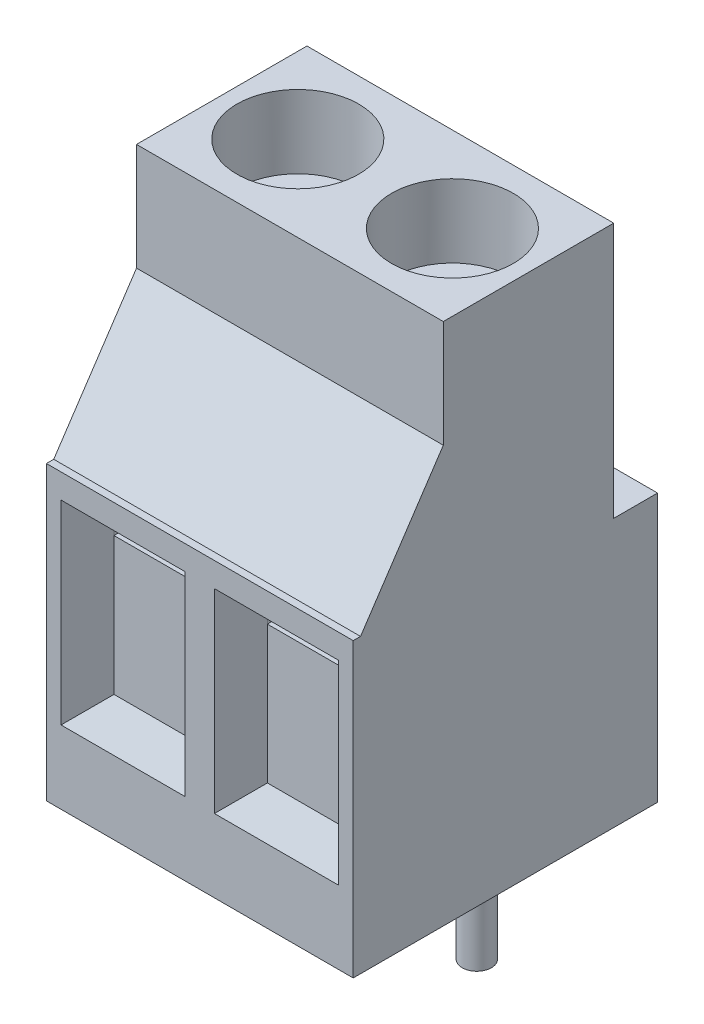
ISO-10303-21;
HEADER;
FILE_DESCRIPTION(('STEP AP214'),'2;1');
FILE_NAME('part.step','',(''),(''),'','','');
FILE_SCHEMA(('AUTOMOTIVE_DESIGN { 1 0 10303 214 1 1 1 1 }'));
ENDSEC;
DATA;
#1=APPLICATION_CONTEXT('core data for automotive mechanical design processes');
#2=APPLICATION_PROTOCOL_DEFINITION('international standard','automotive_design',2000,#1);
#3=PRODUCT_CONTEXT('',#1,'mechanical');
#4=PRODUCT('Part','Part','',(#3));
#5=PRODUCT_RELATED_PRODUCT_CATEGORY('part','',(#4));
#6=PRODUCT_DEFINITION_FORMATION('','',#4);
#7=PRODUCT_DEFINITION_CONTEXT('part definition',#1,'design');
#8=PRODUCT_DEFINITION('design','',#6,#7);
#9=PRODUCT_DEFINITION_SHAPE('','',#8);
#10=(LENGTH_UNIT() NAMED_UNIT(*) SI_UNIT(.MILLI.,.METRE.));
#11=(NAMED_UNIT(*) PLANE_ANGLE_UNIT() SI_UNIT($,.RADIAN.));
#12=(NAMED_UNIT(*) SI_UNIT($,.STERADIAN.) SOLID_ANGLE_UNIT());
#13=UNCERTAINTY_MEASURE_WITH_UNIT(LENGTH_MEASURE(1.E-05),#10,'distance_accuracy_value','');
#14=(GEOMETRIC_REPRESENTATION_CONTEXT(3) GLOBAL_UNCERTAINTY_ASSIGNED_CONTEXT((#13)) GLOBAL_UNIT_ASSIGNED_CONTEXT((#10,
#11,#12)) REPRESENTATION_CONTEXT('',''));
#15=CARTESIAN_POINT('',(0.,0.,0.));
#16=DIRECTION('',(0.,0.,1.));
#17=DIRECTION('',(1.,0.,0.));
#18=AXIS2_PLACEMENT_3D('',#15,#16,#17);
#19=CARTESIAN_POINT('',(0.6,3.,4.25));
#20=DIRECTION('',(0.,0.,1.));
#21=DIRECTION('',(1.,0.,0.));
#22=AXIS2_PLACEMENT_3D('',#19,#20,#21);
#23=PLANE('',#22);
#24=DIRECTION('',(0.,1.,0.));
#25=VECTOR('',#24,1.);
#26=CARTESIAN_POINT('',(5.52502267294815,3.,4.25));
#27=LINE('',#26,#25);
#28=CARTESIAN_POINT('',(5.52502267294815,3.17497732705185,4.25));
#29=VERTEX_POINT('',#28);
#30=CARTESIAN_POINT('',(5.52502267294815,8.82502267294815,4.25));
#31=VERTEX_POINT('',#30);
#32=EDGE_CURVE('E434',#29,#31,#27,.T.);
#33=ORIENTED_EDGE('',*,*,#32,.T.);
#34=DIRECTION('',(-1.,0.,0.));
#35=VECTOR('',#34,1.);
#36=CARTESIAN_POINT('',(5.52502267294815,8.82502267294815,4.25));
#37=LINE('',#36,#35);
#38=CARTESIAN_POINT('',(0.774977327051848,8.82502267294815,4.25));
#39=VERTEX_POINT('',#38);
#40=EDGE_CURVE('E264',#31,#39,#37,.T.);
#41=ORIENTED_EDGE('',*,*,#40,.T.);
#42=DIRECTION('',(0.,-1.,0.));
#43=VECTOR('',#42,1.);
#44=CARTESIAN_POINT('',(0.774977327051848,3.,4.25));
#45=LINE('',#44,#43);
#46=CARTESIAN_POINT('',(0.774977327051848,3.17497732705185,4.25));
#47=VERTEX_POINT('',#46);
#48=EDGE_CURVE('E436',#39,#47,#45,.T.);
#49=ORIENTED_EDGE('',*,*,#48,.T.);
#50=DIRECTION('',(1.,0.,0.));
#51=VECTOR('',#50,1.);
#52=CARTESIAN_POINT('',(0.6,3.17497732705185,4.25));
#53=LINE('',#52,#51);
#54=EDGE_CURVE('E421',#47,#29,#53,.T.);
#55=ORIENTED_EDGE('',*,*,#54,.T.);
#56=EDGE_LOOP('',(#33,#41,#49,#55));
#57=FACE_BOUND('',#56,.T.);
#58=ADVANCED_FACE('F36',(#57),#23,.T.);
#59=CARTESIAN_POINT('',(3.175,18.5,-0.95));
#60=DIRECTION('',(0.,1.,0.));
#61=DIRECTION('',(0.,0.,1.));
#62=AXIS2_PLACEMENT_3D('',#59,#60,#61);
#63=PLANE('',#62);
#64=CARTESIAN_POINT('',(3.175,18.5,-0.95));
#65=DIRECTION('',(0.,1.,0.));
#66=DIRECTION('',(0.,0.,1.));
#67=AXIS2_PLACEMENT_3D('',#64,#65,#66);
#68=CIRCLE('',#67,2.5);
#69=CARTESIAN_POINT('',(3.675,18.5,1.49948974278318));
#70=VERTEX_POINT('',#69);
#71=CARTESIAN_POINT('',(3.675,18.5,-3.39948974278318));
#72=VERTEX_POINT('',#71);
#73=EDGE_CURVE('E370',#70,#72,#68,.T.);
#74=ORIENTED_EDGE('',*,*,#73,.T.);
#75=DIRECTION('',(0.,0.,1.));
#76=VECTOR('',#75,1.);
#77=CARTESIAN_POINT('',(3.675,18.5,-3.39948974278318));
#78=LINE('',#77,#76);
#79=EDGE_CURVE('E298',#72,#70,#78,.T.);
#80=ORIENTED_EDGE('',*,*,#79,.T.);
#81=EDGE_LOOP('',(#74,#80));
#82=FACE_BOUND('',#81,.T.);
#83=ADVANCED_FACE('F536',(#82),#63,.T.);
#84=CARTESIAN_POINT('',(2.675,18.5,-3.39948974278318));
#85=VERTEX_POINT('',#84);
#86=CARTESIAN_POINT('',(2.675,18.5,1.49948974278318));
#87=VERTEX_POINT('',#86);
#88=EDGE_CURVE('E369',#85,#87,#68,.T.);
#89=ORIENTED_EDGE('',*,*,#88,.T.);
#90=DIRECTION('',(0.,0.,-1.));
#91=VECTOR('',#90,1.);
#92=CARTESIAN_POINT('',(2.675,18.5,-3.39948974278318));
#93=LINE('',#92,#91);
#94=EDGE_CURVE('E308',#87,#85,#93,.T.);
#95=ORIENTED_EDGE('',*,*,#94,.T.);
#96=EDGE_LOOP('',(#89,#95));
#97=FACE_BOUND('',#96,.T.);
#98=ADVANCED_FACE('F542',(#97),#63,.T.);
#99=CARTESIAN_POINT('',(-3.175,18.5,-0.949999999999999));
#100=DIRECTION('',(0.,-1.,0.));
#101=DIRECTION('',(0.,0.,-1.));
#102=AXIS2_PLACEMENT_3D('',#99,#100,#101);
#103=PLANE('',#102);
#104=DIRECTION('',(0.,0.,-1.));
#105=VECTOR('',#104,1.);
#106=CARTESIAN_POINT('',(-2.675,18.5,-3.39948974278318));
#107=LINE('',#106,#105);
#108=CARTESIAN_POINT('',(-2.675,18.5,1.49948974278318));
#109=VERTEX_POINT('',#108);
#110=CARTESIAN_POINT('',(-2.675,18.5,-3.39948974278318));
#111=VERTEX_POINT('',#110);
#112=EDGE_CURVE('E322',#109,#111,#107,.T.);
#113=ORIENTED_EDGE('',*,*,#112,.F.);
#114=CARTESIAN_POINT('',(-3.175,18.5,-0.949999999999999));
#115=DIRECTION('',(0.,1.,0.));
#116=DIRECTION('',(0.,0.,-1.));
#117=AXIS2_PLACEMENT_3D('',#114,#115,#116);
#118=CIRCLE('',#117,2.5);
#119=EDGE_CURVE('E362',#109,#111,#118,.T.);
#120=ORIENTED_EDGE('',*,*,#119,.T.);
#121=EDGE_LOOP('',(#113,#120));
#122=FACE_BOUND('',#121,.T.);
#123=ADVANCED_FACE('F661',(#122),#103,.F.);
#124=DIRECTION('',(0.,0.,1.));
#125=VECTOR('',#124,1.);
#126=CARTESIAN_POINT('',(-3.675,18.5,-3.39948974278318));
#127=LINE('',#126,#125);
#128=CARTESIAN_POINT('',(-3.675,18.5,-3.39948974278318));
#129=VERTEX_POINT('',#128);
#130=CARTESIAN_POINT('',(-3.675,18.5,1.49948974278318));
#131=VERTEX_POINT('',#130);
#132=EDGE_CURVE('E332',#129,#131,#127,.T.);
#133=ORIENTED_EDGE('',*,*,#132,.F.);
#134=EDGE_CURVE('E363',#129,#131,#118,.T.);
#135=ORIENTED_EDGE('',*,*,#134,.T.);
#136=EDGE_LOOP('',(#133,#135));
#137=FACE_BOUND('',#136,.T.);
#138=ADVANCED_FACE('F511',(#137),#103,.F.);
#139=CARTESIAN_POINT('',(-6.3,0.,6.25));
#140=DIRECTION('',(0.,1.,0.));
#141=DIRECTION('',(0.,0.,1.));
#142=AXIS2_PLACEMENT_3D('',#139,#140,#141);
#143=PLANE('',#142);
#144=CARTESIAN_POINT('',(-3.175,0.,-1.95));
#145=DIRECTION('',(0.,1.,0.));
#146=DIRECTION('',(0.,0.,1.));
#147=AXIS2_PLACEMENT_3D('',#144,#145,#146);
#148=CIRCLE('',#147,0.6);
#149=CARTESIAN_POINT('',(-3.175,0.,-1.35));
#150=VERTEX_POINT('',#149);
#151=EDGE_CURVE('E44',#150,#150,#148,.F.);
#152=ORIENTED_EDGE('',*,*,#151,.F.);
#153=EDGE_LOOP('',(#152));
#154=FACE_BOUND('',#153,.T.);
#155=DIRECTION('',(0.,0.,1.));
#156=VECTOR('',#155,1.);
#157=CARTESIAN_POINT('',(-6.3,0.,-6.25));
#158=LINE('',#157,#156);
#159=CARTESIAN_POINT('',(-6.3,0.,-6.25));
#160=VERTEX_POINT('',#159);
#161=CARTESIAN_POINT('',(-6.3,0.,6.25));
#162=VERTEX_POINT('',#161);
#163=EDGE_CURVE('E454',#160,#162,#158,.T.);
#164=ORIENTED_EDGE('',*,*,#163,.F.);
#165=DIRECTION('',(-1.,0.,0.));
#166=VECTOR('',#165,1.);
#167=CARTESIAN_POINT('',(-6.3,0.,-6.25));
#168=LINE('',#167,#166);
#169=CARTESIAN_POINT('',(6.3,0.,-6.25));
#170=VERTEX_POINT('',#169);
#171=EDGE_CURVE('E480',#170,#160,#168,.T.);
#172=ORIENTED_EDGE('',*,*,#171,.F.);
#173=DIRECTION('',(0.,0.,-1.));
#174=VECTOR('',#173,1.);
#175=CARTESIAN_POINT('',(6.3,0.,-6.25));
#176=LINE('',#175,#174);
#177=CARTESIAN_POINT('',(6.3,0.,6.25));
#178=VERTEX_POINT('',#177);
#179=EDGE_CURVE('E477',#178,#170,#176,.T.);
#180=ORIENTED_EDGE('',*,*,#179,.F.);
#181=DIRECTION('',(1.,0.,0.));
#182=VECTOR('',#181,1.);
#183=CARTESIAN_POINT('',(-6.3,0.,6.25));
#184=LINE('',#183,#182);
#185=EDGE_CURVE('E474',#162,#178,#184,.T.);
#186=ORIENTED_EDGE('',*,*,#185,.F.);
#187=EDGE_LOOP('',(#164,#172,#180,#186));
#188=FACE_BOUND('',#187,.T.);
#189=CARTESIAN_POINT('',(3.175,0.,-1.95));
#190=DIRECTION('',(0.,1.,0.));
#191=DIRECTION('',(0.,0.,1.));
#192=AXIS2_PLACEMENT_3D('',#189,#190,#191);
#193=CIRCLE('',#192,0.6);
#194=CARTESIAN_POINT('',(3.175,0.,-1.35));
#195=VERTEX_POINT('',#194);
#196=EDGE_CURVE('E11',#195,#195,#193,.F.);
#197=ORIENTED_EDGE('',*,*,#196,.F.);
#198=EDGE_LOOP('',(#197));
#199=FACE_BOUND('',#198,.T.);
#200=ADVANCED_FACE('F508',(#154,#188,#199),#143,.F.);
#201=CARTESIAN_POINT('',(-6.3,21.5,-6.25));
#202=DIRECTION('',(1.,0.,0.));
#203=DIRECTION('',(0.,0.,-1.));
#204=AXIS2_PLACEMENT_3D('',#201,#202,#203);
#205=PLANE('',#204);
#206=DIRECTION('',(0.,-1.,0.));
#207=VECTOR('',#206,1.);
#208=CARTESIAN_POINT('',(-6.3,22.334011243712,-4.45));
#209=LINE('',#208,#207);
#210=CARTESIAN_POINT('',(-6.3,21.5,-4.45));
#211=VERTEX_POINT('',#210);
#212=CARTESIAN_POINT('',(-6.3,11.,-4.45));
#213=VERTEX_POINT('',#212);
#214=EDGE_CURVE('E393',#211,#213,#209,.T.);
#215=ORIENTED_EDGE('',*,*,#214,.T.);
#216=DIRECTION('',(0.,0.,-1.));
#217=VECTOR('',#216,1.);
#218=CARTESIAN_POINT('',(-6.3,11.,-4.45));
#219=LINE('',#218,#217);
#220=CARTESIAN_POINT('',(-6.3,11.,-6.25));
#221=VERTEX_POINT('',#220);
#222=EDGE_CURVE('E396',#213,#221,#219,.T.);
#223=ORIENTED_EDGE('',*,*,#222,.T.);
#224=DIRECTION('',(0.,-1.,0.));
#225=VECTOR('',#224,1.);
#226=CARTESIAN_POINT('',(-6.3,21.5,-6.25));
#227=LINE('',#226,#225);
#228=EDGE_CURVE('E489',#221,#160,#227,.T.);
#229=ORIENTED_EDGE('',*,*,#228,.T.);
#230=ORIENTED_EDGE('',*,*,#163,.T.);
#231=DIRECTION('',(0.,-1.,0.));
#232=VECTOR('',#231,1.);
#233=CARTESIAN_POINT('',(-6.3,21.5,6.25));
#234=LINE('',#233,#232);
#235=CARTESIAN_POINT('',(-6.3,12.,6.25));
#236=VERTEX_POINT('',#235);
#237=EDGE_CURVE('E495',#236,#162,#234,.T.);
#238=ORIENTED_EDGE('',*,*,#237,.F.);
#239=DIRECTION('',(0.,0.,-1.));
#240=VECTOR('',#239,1.);
#241=CARTESIAN_POINT('',(-6.3,12.,7.70302030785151));
#242=LINE('',#241,#240);
#243=CARTESIAN_POINT('',(-6.3,12.,5.95));
#244=VERTEX_POINT('',#243);
#245=EDGE_CURVE('E384',#236,#244,#242,.T.);
#246=ORIENTED_EDGE('',*,*,#245,.T.);
#247=DIRECTION('',(0.,0.832050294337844,-0.554700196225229));
#248=VECTOR('',#247,1.);
#249=CARTESIAN_POINT('',(-6.3,12.,5.95));
#250=LINE('',#249,#248);
#251=CARTESIAN_POINT('',(-6.3,17.1,2.55));
#252=VERTEX_POINT('',#251);
#253=EDGE_CURVE('E387',#244,#252,#250,.T.);
#254=ORIENTED_EDGE('',*,*,#253,.T.);
#255=DIRECTION('',(0.,1.,0.));
#256=VECTOR('',#255,1.);
#257=CARTESIAN_POINT('',(-6.3,17.1,2.55));
#258=LINE('',#257,#256);
#259=CARTESIAN_POINT('',(-6.3,21.5,2.55));
#260=VERTEX_POINT('',#259);
#261=EDGE_CURVE('E390',#252,#260,#258,.T.);
#262=ORIENTED_EDGE('',*,*,#261,.T.);
#263=DIRECTION('',(0.,0.,1.));
#264=VECTOR('',#263,1.);
#265=CARTESIAN_POINT('',(-6.3,21.5,-6.25));
#266=LINE('',#265,#264);
#267=EDGE_CURVE('E483',#211,#260,#266,.T.);
#268=ORIENTED_EDGE('',*,*,#267,.F.);
#269=EDGE_LOOP('',(#215,#223,#229,#230,#238,#246,#254,#262,#268));
#270=FACE_BOUND('',#269,.T.);
#271=ADVANCED_FACE('F38',(#270),#205,.F.);
#272=CARTESIAN_POINT('',(-6.3,21.5,6.25));
#273=DIRECTION('',(0.,0.,-1.));
#274=DIRECTION('',(-1.,0.,0.));
#275=AXIS2_PLACEMENT_3D('',#272,#273,#274);
#276=PLANE('',#275);
#277=DIRECTION('',(0.,1.,0.));
#278=VECTOR('',#277,1.);
#279=CARTESIAN_POINT('',(5.7,3.,6.25));
#280=LINE('',#279,#278);
#281=CARTESIAN_POINT('',(5.7,3.,6.25));
#282=VERTEX_POINT('',#281);
#283=CARTESIAN_POINT('',(5.7,11.,6.25));
#284=VERTEX_POINT('',#283);
#285=EDGE_CURVE('E412',#282,#284,#280,.T.);
#286=ORIENTED_EDGE('',*,*,#285,.F.);
#287=DIRECTION('',(1.,0.,0.));
#288=VECTOR('',#287,1.);
#289=CARTESIAN_POINT('',(0.6,3.,6.25));
#290=LINE('',#289,#288);
#291=CARTESIAN_POINT('',(0.6,3.,6.25));
#292=VERTEX_POINT('',#291);
#293=EDGE_CURVE('E410',#292,#282,#290,.T.);
#294=ORIENTED_EDGE('',*,*,#293,.F.);
#295=DIRECTION('',(0.,-1.,0.));
#296=VECTOR('',#295,1.);
#297=CARTESIAN_POINT('',(0.6,3.,6.25));
#298=LINE('',#297,#296);
#299=CARTESIAN_POINT('',(0.6,11.,6.25));
#300=VERTEX_POINT('',#299);
#301=EDGE_CURVE('E418',#300,#292,#298,.T.);
#302=ORIENTED_EDGE('',*,*,#301,.F.);
#303=DIRECTION('',(-1.,0.,0.));
#304=VECTOR('',#303,1.);
#305=CARTESIAN_POINT('',(0.6,11.,6.25));
#306=LINE('',#305,#304);
#307=EDGE_CURVE('E415',#284,#300,#306,.T.);
#308=ORIENTED_EDGE('',*,*,#307,.F.);
#309=EDGE_LOOP('',(#286,#294,#302,#308));
#310=FACE_BOUND('',#309,.T.);
#311=DIRECTION('',(-1.,0.,0.));
#312=VECTOR('',#311,1.);
#313=CARTESIAN_POINT('',(-0.6,11.,6.25));
#314=LINE('',#313,#312);
#315=CARTESIAN_POINT('',(-0.599999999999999,11.,6.25));
#316=VERTEX_POINT('',#315);
#317=CARTESIAN_POINT('',(-5.7,11.,6.25));
#318=VERTEX_POINT('',#317);
#319=EDGE_CURVE('E442',#316,#318,#314,.T.);
#320=ORIENTED_EDGE('',*,*,#319,.F.);
#321=DIRECTION('',(0.,1.,0.));
#322=VECTOR('',#321,1.);
#323=CARTESIAN_POINT('',(-0.599999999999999,3.,6.25));
#324=LINE('',#323,#322);
#325=CARTESIAN_POINT('',(-0.599999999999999,3.,6.25));
#326=VERTEX_POINT('',#325);
#327=EDGE_CURVE('E424',#326,#316,#324,.T.);
#328=ORIENTED_EDGE('',*,*,#327,.F.);
#329=DIRECTION('',(1.,0.,0.));
#330=VECTOR('',#329,1.);
#331=CARTESIAN_POINT('',(-0.599999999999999,3.,6.25));
#332=LINE('',#331,#330);
#333=CARTESIAN_POINT('',(-5.7,3.,6.25));
#334=VERTEX_POINT('',#333);
#335=EDGE_CURVE('E448',#334,#326,#332,.T.);
#336=ORIENTED_EDGE('',*,*,#335,.F.);
#337=DIRECTION('',(0.,-1.,0.));
#338=VECTOR('',#337,1.);
#339=CARTESIAN_POINT('',(-5.7,3.,6.25));
#340=LINE('',#339,#338);
#341=EDGE_CURVE('E445',#318,#334,#340,.T.);
#342=ORIENTED_EDGE('',*,*,#341,.F.);
#343=EDGE_LOOP('',(#320,#328,#336,#342));
#344=FACE_BOUND('',#343,.T.);
#345=DIRECTION('',(0.,-1.,0.));
#346=VECTOR('',#345,1.);
#347=CARTESIAN_POINT('',(6.3,21.5,6.25));
#348=LINE('',#347,#346);
#349=CARTESIAN_POINT('',(6.3,12.,6.25));
#350=VERTEX_POINT('',#349);
#351=EDGE_CURVE('E493',#350,#178,#348,.T.);
#352=ORIENTED_EDGE('',*,*,#351,.F.);
#353=DIRECTION('',(-1.,0.,0.));
#354=VECTOR('',#353,1.);
#355=CARTESIAN_POINT('',(-6.3,12.,6.25));
#356=LINE('',#355,#354);
#357=EDGE_CURVE('E403',#350,#236,#356,.T.);
#358=ORIENTED_EDGE('',*,*,#357,.T.);
#359=ORIENTED_EDGE('',*,*,#237,.T.);
#360=ORIENTED_EDGE('',*,*,#185,.T.);
#361=EDGE_LOOP('',(#352,#358,#359,#360));
#362=FACE_BOUND('',#361,.T.);
#363=ADVANCED_FACE('F596',(#310,#344,#362),#276,.F.);
#364=CARTESIAN_POINT('',(6.3,21.5,-6.25));
#365=DIRECTION('',(-1.,0.,0.));
#366=DIRECTION('',(0.,0.,1.));
#367=AXIS2_PLACEMENT_3D('',#364,#365,#366);
#368=PLANE('',#367);
#369=DIRECTION('',(0.,-1.,0.));
#370=VECTOR('',#369,1.);
#371=CARTESIAN_POINT('',(6.3,21.5,-6.25));
#372=LINE('',#371,#370);
#373=CARTESIAN_POINT('',(6.3,11.,-6.25));
#374=VERTEX_POINT('',#373);
#375=EDGE_CURVE('E491',#374,#170,#372,.T.);
#376=ORIENTED_EDGE('',*,*,#375,.F.);
#377=DIRECTION('',(0.,0.,-1.));
#378=VECTOR('',#377,1.);
#379=CARTESIAN_POINT('',(6.3,11.,-4.45));
#380=LINE('',#379,#378);
#381=CARTESIAN_POINT('',(6.3,11.,-4.45));
#382=VERTEX_POINT('',#381);
#383=EDGE_CURVE('E382',#382,#374,#380,.T.);
#384=ORIENTED_EDGE('',*,*,#383,.F.);
#385=DIRECTION('',(0.,-1.,0.));
#386=VECTOR('',#385,1.);
#387=CARTESIAN_POINT('',(6.3,22.334011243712,-4.45));
#388=LINE('',#387,#386);
#389=CARTESIAN_POINT('',(6.3,21.5,-4.45));
#390=VERTEX_POINT('',#389);
#391=EDGE_CURVE('E380',#390,#382,#388,.T.);
#392=ORIENTED_EDGE('',*,*,#391,.F.);
#393=DIRECTION('',(0.,0.,-1.));
#394=VECTOR('',#393,1.);
#395=CARTESIAN_POINT('',(6.3,21.5,-6.25));
#396=LINE('',#395,#394);
#397=CARTESIAN_POINT('',(6.3,21.5,2.55));
#398=VERTEX_POINT('',#397);
#399=EDGE_CURVE('E486',#398,#390,#396,.T.);
#400=ORIENTED_EDGE('',*,*,#399,.F.);
#401=DIRECTION('',(0.,1.,0.));
#402=VECTOR('',#401,1.);
#403=CARTESIAN_POINT('',(6.3,17.1,2.55));
#404=LINE('',#403,#402);
#405=CARTESIAN_POINT('',(6.3,17.1,2.55));
#406=VERTEX_POINT('',#405);
#407=EDGE_CURVE('E378',#406,#398,#404,.T.);
#408=ORIENTED_EDGE('',*,*,#407,.F.);
#409=DIRECTION('',(0.,0.832050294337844,-0.554700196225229));
#410=VECTOR('',#409,1.);
#411=CARTESIAN_POINT('',(6.3,12.,5.95));
#412=LINE('',#411,#410);
#413=CARTESIAN_POINT('',(6.3,12.,5.95));
#414=VERTEX_POINT('',#413);
#415=EDGE_CURVE('E375',#414,#406,#412,.T.);
#416=ORIENTED_EDGE('',*,*,#415,.F.);
#417=DIRECTION('',(0.,0.,-1.));
#418=VECTOR('',#417,1.);
#419=CARTESIAN_POINT('',(6.3,12.,7.70302030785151));
#420=LINE('',#419,#418);
#421=EDGE_CURVE('E373',#350,#414,#420,.T.);
#422=ORIENTED_EDGE('',*,*,#421,.F.);
#423=ORIENTED_EDGE('',*,*,#351,.T.);
#424=ORIENTED_EDGE('',*,*,#179,.T.);
#425=EDGE_LOOP('',(#376,#384,#392,#400,#408,#416,#422,#423,#424));
#426=FACE_BOUND('',#425,.T.);
#427=ADVANCED_FACE('F593',(#426),#368,.F.);
#428=CARTESIAN_POINT('',(-6.3,21.5,-6.25));
#429=DIRECTION('',(0.,0.,1.));
#430=DIRECTION('',(1.,0.,0.));
#431=AXIS2_PLACEMENT_3D('',#428,#429,#430);
#432=PLANE('',#431);
#433=ORIENTED_EDGE('',*,*,#228,.F.);
#434=DIRECTION('',(1.,0.,0.));
#435=VECTOR('',#434,1.);
#436=CARTESIAN_POINT('',(-6.3,11.,-6.25));
#437=LINE('',#436,#435);
#438=EDGE_CURVE('E501',#221,#374,#437,.T.);
#439=ORIENTED_EDGE('',*,*,#438,.T.);
#440=ORIENTED_EDGE('',*,*,#375,.T.);
#441=ORIENTED_EDGE('',*,*,#171,.T.);
#442=EDGE_LOOP('',(#433,#439,#440,#441));
#443=FACE_BOUND('',#442,.T.);
#444=ADVANCED_FACE('F589',(#443),#432,.F.);
#445=CARTESIAN_POINT('',(-6.3,21.5,6.25));
#446=DIRECTION('',(0.,1.,0.));
#447=DIRECTION('',(0.,0.,1.));
#448=AXIS2_PLACEMENT_3D('',#445,#446,#447);
#449=PLANE('',#448);
#450=CARTESIAN_POINT('',(-3.175,21.5,-0.949999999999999));
#451=DIRECTION('',(0.,1.,0.));
#452=DIRECTION('',(0.,0.,-1.));
#453=AXIS2_PLACEMENT_3D('',#450,#451,#452);
#454=CIRCLE('',#453,2.5);
#455=CARTESIAN_POINT('',(-3.175,21.5,-3.45));
#456=VERTEX_POINT('',#455);
#457=EDGE_CURVE('E359',#456,#456,#454,.T.);
#458=ORIENTED_EDGE('',*,*,#457,.F.);
#459=EDGE_LOOP('',(#458));
#460=FACE_BOUND('',#459,.T.);
#461=CARTESIAN_POINT('',(3.175,21.5,-0.95));
#462=DIRECTION('',(0.,1.,0.));
#463=DIRECTION('',(0.,0.,1.));
#464=AXIS2_PLACEMENT_3D('',#461,#462,#463);
#465=CIRCLE('',#464,2.5);
#466=CARTESIAN_POINT('',(3.175,21.5,1.55));
#467=VERTEX_POINT('',#466);
#468=EDGE_CURVE('E366',#467,#467,#465,.T.);
#469=ORIENTED_EDGE('',*,*,#468,.F.);
#470=EDGE_LOOP('',(#469));
#471=FACE_BOUND('',#470,.T.);
#472=DIRECTION('',(1.,0.,0.));
#473=VECTOR('',#472,1.);
#474=CARTESIAN_POINT('',(-6.3,21.5,-4.45));
#475=LINE('',#474,#473);
#476=EDGE_CURVE('E499',#211,#390,#475,.T.);
#477=ORIENTED_EDGE('',*,*,#476,.F.);
#478=ORIENTED_EDGE('',*,*,#267,.T.);
#479=DIRECTION('',(-1.,0.,0.));
#480=VECTOR('',#479,1.);
#481=CARTESIAN_POINT('',(-6.3,21.5,2.55));
#482=LINE('',#481,#480);
#483=EDGE_CURVE('E497',#398,#260,#482,.T.);
#484=ORIENTED_EDGE('',*,*,#483,.F.);
#485=ORIENTED_EDGE('',*,*,#399,.T.);
#486=EDGE_LOOP('',(#477,#478,#484,#485));
#487=FACE_BOUND('',#486,.T.);
#488=ADVANCED_FACE('F575',(#460,#471,#487),#449,.T.);
#489=CARTESIAN_POINT('',(-0.599999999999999,3.,6.25));
#490=DIRECTION('',(0.996194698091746,0.,-0.0871557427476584));
#491=DIRECTION('',(-0.0871557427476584,0.,-0.996194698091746));
#492=AXIS2_PLACEMENT_3D('',#489,#490,#491);
#493=PLANE('',#492);
#494=ORIENTED_EDGE('',*,*,#327,.T.);
#495=DIRECTION('',(0.0868265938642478,0.0868265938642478,0.992432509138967));
#496=VECTOR('',#495,1.);
#497=CARTESIAN_POINT('',(-0.660310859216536,10.9396891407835,5.56064372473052));
#498=LINE('',#497,#496);
#499=CARTESIAN_POINT('',(-0.774977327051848,10.8250226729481,4.25));
#500=VERTEX_POINT('',#499);
#501=EDGE_CURVE('E456',#500,#316,#498,.T.);
#502=ORIENTED_EDGE('',*,*,#501,.F.);
#503=DIRECTION('',(0.,1.,0.));
#504=VECTOR('',#503,1.);
#505=CARTESIAN_POINT('',(-0.774977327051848,10.8250226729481,4.25));
#506=LINE('',#505,#504);
#507=CARTESIAN_POINT('',(-0.774977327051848,8.82502267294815,4.25));
#508=VERTEX_POINT('',#507);
#509=EDGE_CURVE('E282',#508,#500,#506,.T.);
#510=ORIENTED_EDGE('',*,*,#509,.F.);
#511=DIRECTION('',(0.,1.,0.));
#512=VECTOR('',#511,1.);
#513=CARTESIAN_POINT('',(-0.774977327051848,11.,4.25));
#514=LINE('',#513,#512);
#515=CARTESIAN_POINT('',(-0.774977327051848,3.17497732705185,4.25));
#516=VERTEX_POINT('',#515);
#517=EDGE_CURVE('E451',#516,#508,#514,.T.);
#518=ORIENTED_EDGE('',*,*,#517,.F.);
#519=DIRECTION('',(0.0868265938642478,-0.0868265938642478,0.992432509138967));
#520=VECTOR('',#519,1.);
#521=CARTESIAN_POINT('',(-0.599999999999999,3.,6.25));
#522=LINE('',#521,#520);
#523=EDGE_CURVE('E452',#516,#326,#522,.T.);
#524=ORIENTED_EDGE('',*,*,#523,.T.);
#525=EDGE_LOOP('',(#494,#502,#510,#518,#524));
#526=FACE_BOUND('',#525,.T.);
#527=ADVANCED_FACE('F571',(#526),#493,.F.);
#528=CARTESIAN_POINT('',(-0.599999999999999,3.,6.25));
#529=DIRECTION('',(0.,-0.996194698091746,-0.0871557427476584));
#530=DIRECTION('',(0.,0.0871557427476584,-0.996194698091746));
#531=AXIS2_PLACEMENT_3D('',#528,#529,#530);
#532=PLANE('',#531);
#533=ORIENTED_EDGE('',*,*,#335,.T.);
#534=ORIENTED_EDGE('',*,*,#523,.F.);
#535=DIRECTION('',(1.,0.,0.));
#536=VECTOR('',#535,1.);
#537=CARTESIAN_POINT('',(-0.599999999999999,3.17497732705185,4.25));
#538=LINE('',#537,#536);
#539=CARTESIAN_POINT('',(-5.52502267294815,3.17497732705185,4.25));
#540=VERTEX_POINT('',#539);
#541=EDGE_CURVE('E460',#540,#516,#538,.T.);
#542=ORIENTED_EDGE('',*,*,#541,.F.);
#543=DIRECTION('',(-0.0868265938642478,-0.0868265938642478,0.992432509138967));
#544=VECTOR('',#543,1.);
#545=CARTESIAN_POINT('',(-5.7,3.,6.25));
#546=LINE('',#545,#544);
#547=EDGE_CURVE('E455',#540,#334,#546,.T.);
#548=ORIENTED_EDGE('',*,*,#547,.T.);
#549=EDGE_LOOP('',(#533,#534,#542,#548));
#550=FACE_BOUND('',#549,.T.);
#551=ADVANCED_FACE('F574',(#550),#532,.F.);
#552=CARTESIAN_POINT('',(-5.7,3.,6.25));
#553=DIRECTION('',(-0.996194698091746,0.,-0.0871557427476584));
#554=DIRECTION('',(-0.0871557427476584,0.,0.996194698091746));
#555=AXIS2_PLACEMENT_3D('',#552,#553,#554);
#556=PLANE('',#555);
#557=ORIENTED_EDGE('',*,*,#341,.T.);
#558=ORIENTED_EDGE('',*,*,#547,.F.);
#559=DIRECTION('',(0.,-1.,0.));
#560=VECTOR('',#559,1.);
#561=CARTESIAN_POINT('',(-5.52502267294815,11.,4.25));
#562=LINE('',#561,#560);
#563=CARTESIAN_POINT('',(-5.52502267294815,8.82502267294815,4.25));
#564=VERTEX_POINT('',#563);
#565=EDGE_CURVE('E469',#564,#540,#562,.T.);
#566=ORIENTED_EDGE('',*,*,#565,.F.);
#567=CARTESIAN_POINT('',(-5.52502267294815,10.8250226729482,4.25));
#568=VERTEX_POINT('',#567);
#569=EDGE_CURVE('E59',#568,#564,#562,.T.);
#570=ORIENTED_EDGE('',*,*,#569,.F.);
#571=DIRECTION('',(-0.0868265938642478,0.0868265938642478,0.992432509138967));
#572=VECTOR('',#571,1.);
#573=CARTESIAN_POINT('',(-5.66155182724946,10.9615518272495,5.8105353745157));
#574=LINE('',#573,#572);
#575=EDGE_CURVE('E459',#568,#318,#574,.T.);
#576=ORIENTED_EDGE('',*,*,#575,.T.);
#577=EDGE_LOOP('',(#557,#558,#566,#570,#576));
#578=FACE_BOUND('',#577,.T.);
#579=ADVANCED_FACE('F579',(#578),#556,.F.);
#580=CARTESIAN_POINT('',(-0.6,11.,6.25));
#581=DIRECTION('',(0.,0.996194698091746,-0.0871557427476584));
#582=DIRECTION('',(0.,0.0871557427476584,0.996194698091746));
#583=AXIS2_PLACEMENT_3D('',#580,#581,#582);
#584=PLANE('',#583);
#585=ORIENTED_EDGE('',*,*,#319,.T.);
#586=ORIENTED_EDGE('',*,*,#575,.F.);
#587=DIRECTION('',(-1.,0.,0.));
#588=VECTOR('',#587,1.);
#589=CARTESIAN_POINT('',(-0.6,10.8250226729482,4.25));
#590=LINE('',#589,#588);
#591=EDGE_CURVE('E465',#500,#568,#590,.T.);
#592=ORIENTED_EDGE('',*,*,#591,.F.);
#593=ORIENTED_EDGE('',*,*,#501,.T.);
#594=EDGE_LOOP('',(#585,#586,#592,#593));
#595=FACE_BOUND('',#594,.T.);
#596=ADVANCED_FACE('F569',(#595),#584,.F.);
#597=CARTESIAN_POINT('',(-0.6,11.,4.25));
#598=DIRECTION('',(0.,0.,1.));
#599=DIRECTION('',(1.,0.,0.));
#600=AXIS2_PLACEMENT_3D('',#597,#598,#599);
#601=PLANE('',#600);
#602=DIRECTION('',(1.,0.,0.));
#603=VECTOR('',#602,1.);
#604=CARTESIAN_POINT('',(-5.52502267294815,8.82502267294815,4.25));
#605=LINE('',#604,#603);
#606=EDGE_CURVE('E274',#564,#508,#605,.T.);
#607=ORIENTED_EDGE('',*,*,#606,.F.);
#608=ORIENTED_EDGE('',*,*,#565,.T.);
#609=ORIENTED_EDGE('',*,*,#541,.T.);
#610=ORIENTED_EDGE('',*,*,#517,.T.);
#611=EDGE_LOOP('',(#607,#608,#609,#610));
#612=FACE_BOUND('',#611,.T.);
#613=ADVANCED_FACE('F553',(#612),#601,.T.);
#614=CARTESIAN_POINT('',(0.6,3.,6.25));
#615=DIRECTION('',(0.,-0.996194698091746,-0.0871557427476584));
#616=DIRECTION('',(0.,0.0871557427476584,-0.996194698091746));
#617=AXIS2_PLACEMENT_3D('',#614,#615,#616);
#618=PLANE('',#617);
#619=ORIENTED_EDGE('',*,*,#293,.T.);
#620=DIRECTION('',(0.0868265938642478,-0.0868265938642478,0.992432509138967));
#621=VECTOR('',#620,1.);
#622=CARTESIAN_POINT('',(5.66155182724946,3.03844817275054,5.8105353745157));
#623=LINE('',#622,#621);
#624=EDGE_CURVE('E426',#29,#282,#623,.T.);
#625=ORIENTED_EDGE('',*,*,#624,.F.);
#626=ORIENTED_EDGE('',*,*,#54,.F.);
#627=DIRECTION('',(-0.0868265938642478,-0.0868265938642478,0.992432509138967));
#628=VECTOR('',#627,1.);
#629=CARTESIAN_POINT('',(0.6,3.,6.25));
#630=LINE('',#629,#628);
#631=EDGE_CURVE('E422',#47,#292,#630,.T.);
#632=ORIENTED_EDGE('',*,*,#631,.T.);
#633=EDGE_LOOP('',(#619,#625,#626,#632));
#634=FACE_BOUND('',#633,.T.);
#635=ADVANCED_FACE('F549',(#634),#618,.F.);
#636=CARTESIAN_POINT('',(0.6,3.,6.25));
#637=DIRECTION('',(-0.996194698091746,0.,-0.0871557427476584));
#638=DIRECTION('',(-0.0871557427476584,0.,0.996194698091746));
#639=AXIS2_PLACEMENT_3D('',#636,#637,#638);
#640=PLANE('',#639);
#641=ORIENTED_EDGE('',*,*,#301,.T.);
#642=ORIENTED_EDGE('',*,*,#631,.F.);
#643=ORIENTED_EDGE('',*,*,#48,.F.);
#644=CARTESIAN_POINT('',(0.774977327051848,10.8250226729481,4.25));
#645=VERTEX_POINT('',#644);
#646=EDGE_CURVE('E51',#645,#39,#45,.T.);
#647=ORIENTED_EDGE('',*,*,#646,.F.);
#648=DIRECTION('',(-0.0868265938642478,0.0868265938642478,0.992432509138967));
#649=VECTOR('',#648,1.);
#650=CARTESIAN_POINT('',(0.6,11.,6.25));
#651=LINE('',#650,#649);
#652=EDGE_CURVE('E425',#645,#300,#651,.T.);
#653=ORIENTED_EDGE('',*,*,#652,.T.);
#654=EDGE_LOOP('',(#641,#642,#643,#647,#653));
#655=FACE_BOUND('',#654,.T.);
#656=ADVANCED_FACE('F552',(#655),#640,.F.);
#657=CARTESIAN_POINT('',(0.6,11.,6.25));
#658=DIRECTION('',(0.,0.996194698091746,-0.0871557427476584));
#659=DIRECTION('',(0.,0.0871557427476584,0.996194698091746));
#660=AXIS2_PLACEMENT_3D('',#657,#658,#659);
#661=PLANE('',#660);
#662=ORIENTED_EDGE('',*,*,#307,.T.);
#663=ORIENTED_EDGE('',*,*,#652,.F.);
#664=DIRECTION('',(-1.,0.,0.));
#665=VECTOR('',#664,1.);
#666=CARTESIAN_POINT('',(0.6,10.8250226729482,4.25));
#667=LINE('',#666,#665);
#668=CARTESIAN_POINT('',(5.52502267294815,10.8250226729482,4.25));
#669=VERTEX_POINT('',#668);
#670=EDGE_CURVE('E437',#669,#645,#667,.T.);
#671=ORIENTED_EDGE('',*,*,#670,.F.);
#672=DIRECTION('',(0.0868265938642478,0.0868265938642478,0.992432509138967));
#673=VECTOR('',#672,1.);
#674=CARTESIAN_POINT('',(5.63968914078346,10.9396891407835,5.56064372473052));
#675=LINE('',#674,#673);
#676=EDGE_CURVE('E429',#669,#284,#675,.T.);
#677=ORIENTED_EDGE('',*,*,#676,.T.);
#678=EDGE_LOOP('',(#662,#663,#671,#677));
#679=FACE_BOUND('',#678,.T.);
#680=ADVANCED_FACE('F559',(#679),#661,.F.);
#681=CARTESIAN_POINT('',(5.7,3.,6.25));
#682=DIRECTION('',(0.996194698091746,0.,-0.0871557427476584));
#683=DIRECTION('',(-0.0871557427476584,0.,-0.996194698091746));
#684=AXIS2_PLACEMENT_3D('',#681,#682,#683);
#685=PLANE('',#684);
#686=ORIENTED_EDGE('',*,*,#285,.T.);
#687=ORIENTED_EDGE('',*,*,#676,.F.);
#688=DIRECTION('',(0.,-1.,0.));
#689=VECTOR('',#688,1.);
#690=CARTESIAN_POINT('',(5.52502267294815,10.8250226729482,4.25));
#691=LINE('',#690,#689);
#692=EDGE_CURVE('E259',#669,#31,#691,.T.);
#693=ORIENTED_EDGE('',*,*,#692,.T.);
#694=ORIENTED_EDGE('',*,*,#32,.F.);
#695=ORIENTED_EDGE('',*,*,#624,.T.);
#696=EDGE_LOOP('',(#686,#687,#693,#694,#695));
#697=FACE_BOUND('',#696,.T.);
#698=ADVANCED_FACE('F555',(#697),#685,.F.);
#699=CARTESIAN_POINT('',(-6.3,17.1,2.55));
#700=DIRECTION('',(0.,0.,-1.));
#701=DIRECTION('',(-1.,0.,0.));
#702=AXIS2_PLACEMENT_3D('',#699,#700,#701);
#703=PLANE('',#702);
#704=ORIENTED_EDGE('',*,*,#483,.T.);
#705=ORIENTED_EDGE('',*,*,#261,.F.);
#706=DIRECTION('',(1.,0.,0.));
#707=VECTOR('',#706,1.);
#708=CARTESIAN_POINT('',(-6.3,17.1,2.55));
#709=LINE('',#708,#707);
#710=EDGE_CURVE('E404',#252,#406,#709,.T.);
#711=ORIENTED_EDGE('',*,*,#710,.T.);
#712=ORIENTED_EDGE('',*,*,#407,.T.);
#713=EDGE_LOOP('',(#704,#705,#711,#712));
#714=FACE_BOUND('',#713,.T.);
#715=ADVANCED_FACE('F558',(#714),#703,.F.);
#716=CARTESIAN_POINT('',(-6.3,12.,7.70302030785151));
#717=DIRECTION('',(0.,-1.,0.));
#718=DIRECTION('',(0.,0.,-1.));
#719=AXIS2_PLACEMENT_3D('',#716,#717,#718);
#720=PLANE('',#719);
#721=ORIENTED_EDGE('',*,*,#421,.T.);
#722=DIRECTION('',(1.,0.,0.));
#723=VECTOR('',#722,1.);
#724=CARTESIAN_POINT('',(-6.3,12.,5.95));
#725=LINE('',#724,#723);
#726=EDGE_CURVE('E399',#244,#414,#725,.T.);
#727=ORIENTED_EDGE('',*,*,#726,.F.);
#728=ORIENTED_EDGE('',*,*,#245,.F.);
#729=ORIENTED_EDGE('',*,*,#357,.F.);
#730=EDGE_LOOP('',(#721,#727,#728,#729));
#731=FACE_BOUND('',#730,.T.);
#732=ADVANCED_FACE('F547',(#731),#720,.F.);
#733=CARTESIAN_POINT('',(-6.3,12.,5.95));
#734=DIRECTION('',(0.,-0.554700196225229,-0.832050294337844));
#735=DIRECTION('',(0.,0.832050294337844,-0.554700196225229));
#736=AXIS2_PLACEMENT_3D('',#733,#734,#735);
#737=PLANE('',#736);
#738=ORIENTED_EDGE('',*,*,#415,.T.);
#739=ORIENTED_EDGE('',*,*,#710,.F.);
#740=ORIENTED_EDGE('',*,*,#253,.F.);
#741=ORIENTED_EDGE('',*,*,#726,.T.);
#742=EDGE_LOOP('',(#738,#739,#740,#741));
#743=FACE_BOUND('',#742,.T.);
#744=ADVANCED_FACE('F622',(#743),#737,.F.);
#745=CARTESIAN_POINT('',(-6.3,11.,-4.45));
#746=DIRECTION('',(0.,-1.,0.));
#747=DIRECTION('',(0.,0.,-1.));
#748=AXIS2_PLACEMENT_3D('',#745,#746,#747);
#749=PLANE('',#748);
#750=ORIENTED_EDGE('',*,*,#222,.F.);
#751=DIRECTION('',(1.,0.,0.));
#752=VECTOR('',#751,1.);
#753=CARTESIAN_POINT('',(-6.3,11.,-4.45));
#754=LINE('',#753,#752);
#755=EDGE_CURVE('E400',#213,#382,#754,.T.);
#756=ORIENTED_EDGE('',*,*,#755,.T.);
#757=ORIENTED_EDGE('',*,*,#383,.T.);
#758=ORIENTED_EDGE('',*,*,#438,.F.);
#759=EDGE_LOOP('',(#750,#756,#757,#758));
#760=FACE_BOUND('',#759,.T.);
#761=ADVANCED_FACE('F630',(#760),#749,.F.);
#762=CARTESIAN_POINT('',(-6.3,22.334011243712,-4.45));
#763=DIRECTION('',(0.,0.,1.));
#764=DIRECTION('',(0.,-1.,0.));
#765=AXIS2_PLACEMENT_3D('',#762,#763,#764);
#766=PLANE('',#765);
#767=ORIENTED_EDGE('',*,*,#476,.T.);
#768=ORIENTED_EDGE('',*,*,#391,.T.);
#769=ORIENTED_EDGE('',*,*,#755,.F.);
#770=ORIENTED_EDGE('',*,*,#214,.F.);
#771=EDGE_LOOP('',(#767,#768,#769,#770));
#772=FACE_BOUND('',#771,.T.);
#773=ADVANCED_FACE('F632',(#772),#766,.F.);
#774=CARTESIAN_POINT('',(3.175,18.5,-0.95));
#775=DIRECTION('',(0.,1.,0.));
#776=DIRECTION('',(0.,0.,1.));
#777=AXIS2_PLACEMENT_3D('',#774,#775,#776);
#778=CYLINDRICAL_SURFACE('',#777,2.5);
#779=ORIENTED_EDGE('',*,*,#73,.F.);
#780=DIRECTION('',(0.,1.,0.));
#781=VECTOR('',#780,1.);
#782=CARTESIAN_POINT('',(3.675,17.5,1.49948974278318));
#783=LINE('',#782,#781);
#784=CARTESIAN_POINT('',(3.675,17.5,1.49948974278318));
#785=VERTEX_POINT('',#784);
#786=EDGE_CURVE('E314',#785,#70,#783,.T.);
#787=ORIENTED_EDGE('',*,*,#786,.F.);
#788=CARTESIAN_POINT('',(3.175,17.5,-0.949999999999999));
#789=DIRECTION('',(0.,-1.,0.));
#790=DIRECTION('',(0.,0.,1.));
#791=AXIS2_PLACEMENT_3D('',#788,#789,#790);
#792=CIRCLE('',#791,2.5);
#793=CARTESIAN_POINT('',(2.675,17.5,1.49948974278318));
#794=VERTEX_POINT('',#793);
#795=EDGE_CURVE('E304',#785,#794,#792,.T.);
#796=ORIENTED_EDGE('',*,*,#795,.T.);
#797=DIRECTION('',(0.,1.,0.));
#798=VECTOR('',#797,1.);
#799=CARTESIAN_POINT('',(2.675,17.5,1.49948974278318));
#800=LINE('',#799,#798);
#801=EDGE_CURVE('E319',#794,#87,#800,.T.);
#802=ORIENTED_EDGE('',*,*,#801,.T.);
#803=ORIENTED_EDGE('',*,*,#88,.F.);
#804=DIRECTION('',(0.,1.,0.));
#805=VECTOR('',#804,1.);
#806=CARTESIAN_POINT('',(2.675,17.5,-3.39948974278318));
#807=LINE('',#806,#805);
#808=CARTESIAN_POINT('',(2.675,17.5,-3.39948974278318));
#809=VERTEX_POINT('',#808);
#810=EDGE_CURVE('E323',#809,#85,#807,.T.);
#811=ORIENTED_EDGE('',*,*,#810,.F.);
#812=CARTESIAN_POINT('',(3.175,17.5,-0.949999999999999));
#813=DIRECTION('',(0.,-1.,0.));
#814=DIRECTION('',(0.,0.,1.));
#815=AXIS2_PLACEMENT_3D('',#812,#813,#814);
#816=CIRCLE('',#815,2.5);
#817=CARTESIAN_POINT('',(3.675,17.5,-3.39948974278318));
#818=VERTEX_POINT('',#817);
#819=EDGE_CURVE('E310',#809,#818,#816,.T.);
#820=ORIENTED_EDGE('',*,*,#819,.T.);
#821=DIRECTION('',(0.,1.,0.));
#822=VECTOR('',#821,1.);
#823=CARTESIAN_POINT('',(3.675,17.5,-3.39948974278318));
#824=LINE('',#823,#822);
#825=EDGE_CURVE('E325',#818,#72,#824,.T.);
#826=ORIENTED_EDGE('',*,*,#825,.T.);
#827=EDGE_LOOP('',(#779,#787,#796,#802,#803,#811,#820,#826));
#828=FACE_BOUND('',#827,.T.);
#829=ORIENTED_EDGE('',*,*,#468,.T.);
#830=EDGE_LOOP('',(#829));
#831=FACE_BOUND('',#830,.T.);
#832=ADVANCED_FACE('F652',(#828,#831),#778,.F.);
#833=CARTESIAN_POINT('',(-3.175,18.5,-0.949999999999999));
#834=DIRECTION('',(0.,1.,0.));
#835=DIRECTION('',(0.,0.,1.));
#836=AXIS2_PLACEMENT_3D('',#833,#834,#835);
#837=CYLINDRICAL_SURFACE('',#836,2.5);
#838=ORIENTED_EDGE('',*,*,#134,.F.);
#839=DIRECTION('',(0.,1.,0.));
#840=VECTOR('',#839,1.);
#841=CARTESIAN_POINT('',(-3.675,17.5,-3.39948974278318));
#842=LINE('',#841,#840);
#843=CARTESIAN_POINT('',(-3.675,17.5,-3.39948974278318));
#844=VERTEX_POINT('',#843);
#845=EDGE_CURVE('E349',#844,#129,#842,.T.);
#846=ORIENTED_EDGE('',*,*,#845,.F.);
#847=CARTESIAN_POINT('',(-3.175,17.5,-0.949999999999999));
#848=DIRECTION('',(0.,1.,0.));
#849=DIRECTION('',(0.,0.,1.));
#850=AXIS2_PLACEMENT_3D('',#847,#848,#849);
#851=CIRCLE('',#850,2.5);
#852=CARTESIAN_POINT('',(-2.675,17.5,-3.39948974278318));
#853=VERTEX_POINT('',#852);
#854=EDGE_CURVE('E335',#853,#844,#851,.T.);
#855=ORIENTED_EDGE('',*,*,#854,.F.);
#856=DIRECTION('',(0.,1.,0.));
#857=VECTOR('',#856,1.);
#858=CARTESIAN_POINT('',(-2.675,17.5,-3.39948974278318));
#859=LINE('',#858,#857);
#860=EDGE_CURVE('E351',#853,#111,#859,.T.);
#861=ORIENTED_EDGE('',*,*,#860,.T.);
#862=ORIENTED_EDGE('',*,*,#119,.F.);
#863=DIRECTION('',(0.,1.,0.));
#864=VECTOR('',#863,1.);
#865=CARTESIAN_POINT('',(-2.675,17.5,1.49948974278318));
#866=LINE('',#865,#864);
#867=CARTESIAN_POINT('',(-2.675,17.5,1.49948974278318));
#868=VERTEX_POINT('',#867);
#869=EDGE_CURVE('E341',#868,#109,#866,.T.);
#870=ORIENTED_EDGE('',*,*,#869,.F.);
#871=CARTESIAN_POINT('',(-3.175,17.5,-0.949999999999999));
#872=DIRECTION('',(0.,1.,0.));
#873=DIRECTION('',(0.,0.,1.));
#874=AXIS2_PLACEMENT_3D('',#871,#872,#873);
#875=CIRCLE('',#874,2.5);
#876=CARTESIAN_POINT('',(-3.675,17.5,1.49948974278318));
#877=VERTEX_POINT('',#876);
#878=EDGE_CURVE('E328',#877,#868,#875,.T.);
#879=ORIENTED_EDGE('',*,*,#878,.F.);
#880=DIRECTION('',(0.,1.,0.));
#881=VECTOR('',#880,1.);
#882=CARTESIAN_POINT('',(-3.675,17.5,1.49948974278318));
#883=LINE('',#882,#881);
#884=EDGE_CURVE('E346',#877,#131,#883,.T.);
#885=ORIENTED_EDGE('',*,*,#884,.T.);
#886=EDGE_LOOP('',(#838,#846,#855,#861,#862,#870,#879,#885));
#887=FACE_BOUND('',#886,.T.);
#888=ORIENTED_EDGE('',*,*,#457,.T.);
#889=EDGE_LOOP('',(#888));
#890=FACE_BOUND('',#889,.T.);
#891=ADVANCED_FACE('F655',(#887,#890),#837,.F.);
#892=CARTESIAN_POINT('',(-3.175,-5.,-1.95));
#893=DIRECTION('',(0.,1.,0.));
#894=DIRECTION('',(0.,0.,1.));
#895=AXIS2_PLACEMENT_3D('',#892,#893,#894);
#896=CYLINDRICAL_SURFACE('',#895,0.6);
#897=CARTESIAN_POINT('',(-3.175,-5.,-1.95));
#898=DIRECTION('',(0.,-1.,0.));
#899=DIRECTION('',(0.,0.,-1.));
#900=AXIS2_PLACEMENT_3D('',#897,#898,#899);
#901=CIRCLE('',#900,0.6);
#902=CARTESIAN_POINT('',(-3.175,-5.,-2.55));
#903=VERTEX_POINT('',#902);
#904=EDGE_CURVE('E356',#903,#903,#901,.T.);
#905=ORIENTED_EDGE('',*,*,#904,.F.);
#906=EDGE_LOOP('',(#905));
#907=FACE_BOUND('',#906,.T.);
#908=ORIENTED_EDGE('',*,*,#151,.T.);
#909=EDGE_LOOP('',(#908));
#910=FACE_BOUND('',#909,.T.);
#911=ADVANCED_FACE('F506',(#907,#910),#896,.T.);
#912=CARTESIAN_POINT('',(-3.175,-5.,-1.95));
#913=DIRECTION('',(0.,-1.,0.));
#914=DIRECTION('',(0.,0.,-1.));
#915=AXIS2_PLACEMENT_3D('',#912,#913,#914);
#916=PLANE('',#915);
#917=ORIENTED_EDGE('',*,*,#904,.T.);
#918=EDGE_LOOP('',(#917));
#919=FACE_BOUND('',#918,.T.);
#920=ADVANCED_FACE('F522',(#919),#916,.T.);
#921=CARTESIAN_POINT('',(3.175,-5.,-1.95));
#922=DIRECTION('',(0.,1.,0.));
#923=DIRECTION('',(0.,0.,1.));
#924=AXIS2_PLACEMENT_3D('',#921,#922,#923);
#925=CYLINDRICAL_SURFACE('',#924,0.6);
#926=CARTESIAN_POINT('',(3.175,-5.,-1.95));
#927=DIRECTION('',(0.,-1.,0.));
#928=DIRECTION('',(0.,0.,1.));
#929=AXIS2_PLACEMENT_3D('',#926,#927,#928);
#930=CIRCLE('',#929,0.6);
#931=CARTESIAN_POINT('',(3.175,-5.,-1.35));
#932=VERTEX_POINT('',#931);
#933=EDGE_CURVE('E348',#932,#932,#930,.T.);
#934=ORIENTED_EDGE('',*,*,#933,.F.);
#935=EDGE_LOOP('',(#934));
#936=FACE_BOUND('',#935,.T.);
#937=ORIENTED_EDGE('',*,*,#196,.T.);
#938=EDGE_LOOP('',(#937));
#939=FACE_BOUND('',#938,.T.);
#940=ADVANCED_FACE('F519',(#936,#939),#925,.T.);
#941=CARTESIAN_POINT('',(3.175,-5.,-1.95));
#942=DIRECTION('',(0.,1.,0.));
#943=DIRECTION('',(0.,0.,1.));
#944=AXIS2_PLACEMENT_3D('',#941,#942,#943);
#945=PLANE('',#944);
#946=ORIENTED_EDGE('',*,*,#933,.T.);
#947=EDGE_LOOP('',(#946));
#948=FACE_BOUND('',#947,.T.);
#949=ADVANCED_FACE('F521',(#948),#945,.F.);
#950=CARTESIAN_POINT('',(-3.675,17.5,-3.39948974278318));
#951=DIRECTION('',(-1.,0.,0.));
#952=DIRECTION('',(0.,0.,1.));
#953=AXIS2_PLACEMENT_3D('',#950,#951,#952);
#954=PLANE('',#953);
#955=ORIENTED_EDGE('',*,*,#132,.T.);
#956=ORIENTED_EDGE('',*,*,#884,.F.);
#957=DIRECTION('',(0.,0.,1.));
#958=VECTOR('',#957,1.);
#959=CARTESIAN_POINT('',(-3.675,17.5,-3.39948974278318));
#960=LINE('',#959,#958);
#961=EDGE_CURVE('E338',#844,#877,#960,.T.);
#962=ORIENTED_EDGE('',*,*,#961,.F.);
#963=ORIENTED_EDGE('',*,*,#845,.T.);
#964=EDGE_LOOP('',(#955,#956,#962,#963));
#965=FACE_BOUND('',#964,.T.);
#966=ADVANCED_FACE('F529',(#965),#954,.F.);
#967=CARTESIAN_POINT('',(-2.675,17.5,-3.39948974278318));
#968=DIRECTION('',(1.,0.,0.));
#969=DIRECTION('',(0.,0.,-1.));
#970=AXIS2_PLACEMENT_3D('',#967,#968,#969);
#971=PLANE('',#970);
#972=ORIENTED_EDGE('',*,*,#112,.T.);
#973=ORIENTED_EDGE('',*,*,#860,.F.);
#974=DIRECTION('',(0.,0.,-1.));
#975=VECTOR('',#974,1.);
#976=CARTESIAN_POINT('',(-2.675,17.5,-3.39948974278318));
#977=LINE('',#976,#975);
#978=EDGE_CURVE('E331',#868,#853,#977,.T.);
#979=ORIENTED_EDGE('',*,*,#978,.F.);
#980=ORIENTED_EDGE('',*,*,#869,.T.);
#981=EDGE_LOOP('',(#972,#973,#979,#980));
#982=FACE_BOUND('',#981,.T.);
#983=ADVANCED_FACE('F731',(#982),#971,.F.);
#984=CARTESIAN_POINT('',(-3.175,17.5,-0.949999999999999));
#985=DIRECTION('',(0.,1.,0.));
#986=DIRECTION('',(0.,0.,1.));
#987=AXIS2_PLACEMENT_3D('',#984,#985,#986);
#988=PLANE('',#987);
#989=ORIENTED_EDGE('',*,*,#878,.T.);
#990=ORIENTED_EDGE('',*,*,#978,.T.);
#991=ORIENTED_EDGE('',*,*,#854,.T.);
#992=ORIENTED_EDGE('',*,*,#961,.T.);
#993=EDGE_LOOP('',(#989,#990,#991,#992));
#994=FACE_BOUND('',#993,.T.);
#995=ADVANCED_FACE('F741',(#994),#988,.T.);
#996=CARTESIAN_POINT('',(2.675,17.5,-3.39948974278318));
#997=DIRECTION('',(1.,0.,0.));
#998=DIRECTION('',(0.,0.,-1.));
#999=AXIS2_PLACEMENT_3D('',#996,#997,#998);
#1000=PLANE('',#999);
#1001=ORIENTED_EDGE('',*,*,#94,.F.);
#1002=ORIENTED_EDGE('',*,*,#801,.F.);
#1003=DIRECTION('',(0.,0.,-1.));
#1004=VECTOR('',#1003,1.);
#1005=CARTESIAN_POINT('',(2.675,17.5,-3.39948974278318));
#1006=LINE('',#1005,#1004);
#1007=EDGE_CURVE('E312',#794,#809,#1006,.T.);
#1008=ORIENTED_EDGE('',*,*,#1007,.T.);
#1009=ORIENTED_EDGE('',*,*,#810,.T.);
#1010=EDGE_LOOP('',(#1001,#1002,#1008,#1009));
#1011=FACE_BOUND('',#1010,.T.);
#1012=ADVANCED_FACE('F750',(#1011),#1000,.T.);
#1013=CARTESIAN_POINT('',(3.675,17.5,-3.39948974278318));
#1014=DIRECTION('',(-1.,0.,0.));
#1015=DIRECTION('',(0.,0.,1.));
#1016=AXIS2_PLACEMENT_3D('',#1013,#1014,#1015);
#1017=PLANE('',#1016);
#1018=ORIENTED_EDGE('',*,*,#79,.F.);
#1019=ORIENTED_EDGE('',*,*,#825,.F.);
#1020=DIRECTION('',(0.,0.,1.));
#1021=VECTOR('',#1020,1.);
#1022=CARTESIAN_POINT('',(3.675,17.5,-3.39948974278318));
#1023=LINE('',#1022,#1021);
#1024=EDGE_CURVE('E307',#818,#785,#1023,.T.);
#1025=ORIENTED_EDGE('',*,*,#1024,.T.);
#1026=ORIENTED_EDGE('',*,*,#786,.T.);
#1027=EDGE_LOOP('',(#1018,#1019,#1025,#1026));
#1028=FACE_BOUND('',#1027,.T.);
#1029=ADVANCED_FACE('F786',(#1028),#1017,.T.);
#1030=CARTESIAN_POINT('',(3.175,17.5,-0.949999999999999));
#1031=DIRECTION('',(0.,1.,0.));
#1032=DIRECTION('',(0.,0.,1.));
#1033=AXIS2_PLACEMENT_3D('',#1030,#1031,#1032);
#1034=PLANE('',#1033);
#1035=ORIENTED_EDGE('',*,*,#795,.F.);
#1036=ORIENTED_EDGE('',*,*,#1024,.F.);
#1037=ORIENTED_EDGE('',*,*,#819,.F.);
#1038=ORIENTED_EDGE('',*,*,#1007,.F.);
#1039=EDGE_LOOP('',(#1035,#1036,#1037,#1038));
#1040=FACE_BOUND('',#1039,.T.);
#1041=ADVANCED_FACE('F796',(#1040),#1034,.T.);
#1042=CARTESIAN_POINT('',(-5.52502267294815,10.8250226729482,-3.75));
#1043=DIRECTION('',(-1.,0.,0.));
#1044=DIRECTION('',(0.,0.,1.));
#1045=AXIS2_PLACEMENT_3D('',#1042,#1043,#1044);
#1046=PLANE('',#1045);
#1047=ORIENTED_EDGE('',*,*,#569,.T.);
#1048=DIRECTION('',(0.,0.,1.));
#1049=VECTOR('',#1048,1.);
#1050=CARTESIAN_POINT('',(-5.52502267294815,8.82502267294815,-3.75));
#1051=LINE('',#1050,#1049);
#1052=CARTESIAN_POINT('',(-5.52502267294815,8.82502267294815,-3.75));
#1053=VERTEX_POINT('',#1052);
#1054=EDGE_CURVE('E291',#1053,#564,#1051,.T.);
#1055=ORIENTED_EDGE('',*,*,#1054,.F.);
#1056=DIRECTION('',(0.,-1.,0.));
#1057=VECTOR('',#1056,1.);
#1058=CARTESIAN_POINT('',(-5.52502267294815,10.8250226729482,-3.75));
#1059=LINE('',#1058,#1057);
#1060=CARTESIAN_POINT('',(-5.52502267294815,10.8250226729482,-3.75));
#1061=VERTEX_POINT('',#1060);
#1062=EDGE_CURVE('E278',#1061,#1053,#1059,.T.);
#1063=ORIENTED_EDGE('',*,*,#1062,.F.);
#1064=DIRECTION('',(0.,0.,1.));
#1065=VECTOR('',#1064,1.);
#1066=CARTESIAN_POINT('',(-5.52502267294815,10.8250226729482,-3.75));
#1067=LINE('',#1066,#1065);
#1068=EDGE_CURVE('E296',#1061,#568,#1067,.T.);
#1069=ORIENTED_EDGE('',*,*,#1068,.T.);
#1070=EDGE_LOOP('',(#1047,#1055,#1063,#1069));
#1071=FACE_BOUND('',#1070,.T.);
#1072=ADVANCED_FACE('F806',(#1071),#1046,.F.);
#1073=CARTESIAN_POINT('',(-5.52502267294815,10.8250226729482,-3.75));
#1074=DIRECTION('',(0.,1.,0.));
#1075=DIRECTION('',(-1.,0.,0.));
#1076=AXIS2_PLACEMENT_3D('',#1073,#1074,#1075);
#1077=PLANE('',#1076);
#1078=ORIENTED_EDGE('',*,*,#591,.T.);
#1079=ORIENTED_EDGE('',*,*,#1068,.F.);
#1080=DIRECTION('',(-1.,0.,0.));
#1081=VECTOR('',#1080,1.);
#1082=CARTESIAN_POINT('',(-5.52502267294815,10.8250226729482,-3.75));
#1083=LINE('',#1082,#1081);
#1084=CARTESIAN_POINT('',(-0.774977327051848,10.8250226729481,-3.75));
#1085=VERTEX_POINT('',#1084);
#1086=EDGE_CURVE('E288',#1085,#1061,#1083,.T.);
#1087=ORIENTED_EDGE('',*,*,#1086,.F.);
#1088=DIRECTION('',(0.,0.,1.));
#1089=VECTOR('',#1088,1.);
#1090=CARTESIAN_POINT('',(-0.774977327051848,10.8250226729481,-3.75));
#1091=LINE('',#1090,#1089);
#1092=EDGE_CURVE('E299',#1085,#500,#1091,.T.);
#1093=ORIENTED_EDGE('',*,*,#1092,.T.);
#1094=EDGE_LOOP('',(#1078,#1079,#1087,#1093));
#1095=FACE_BOUND('',#1094,.T.);
#1096=ADVANCED_FACE('F817',(#1095),#1077,.F.);
#1097=CARTESIAN_POINT('',(-0.774977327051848,10.8250226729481,-3.75));
#1098=DIRECTION('',(1.,0.,0.));
#1099=DIRECTION('',(0.,1.,0.));
#1100=AXIS2_PLACEMENT_3D('',#1097,#1098,#1099);
#1101=PLANE('',#1100);
#1102=ORIENTED_EDGE('',*,*,#509,.T.);
#1103=ORIENTED_EDGE('',*,*,#1092,.F.);
#1104=DIRECTION('',(0.,1.,0.));
#1105=VECTOR('',#1104,1.);
#1106=CARTESIAN_POINT('',(-0.774977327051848,10.8250226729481,-3.75));
#1107=LINE('',#1106,#1105);
#1108=CARTESIAN_POINT('',(-0.774977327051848,8.82502267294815,-3.75));
#1109=VERTEX_POINT('',#1108);
#1110=EDGE_CURVE('E285',#1109,#1085,#1107,.T.);
#1111=ORIENTED_EDGE('',*,*,#1110,.F.);
#1112=DIRECTION('',(0.,0.,1.));
#1113=VECTOR('',#1112,1.);
#1114=CARTESIAN_POINT('',(-0.774977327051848,8.82502267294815,-3.75));
#1115=LINE('',#1114,#1113);
#1116=EDGE_CURVE('E301',#1109,#508,#1115,.T.);
#1117=ORIENTED_EDGE('',*,*,#1116,.T.);
#1118=EDGE_LOOP('',(#1102,#1103,#1111,#1117));
#1119=FACE_BOUND('',#1118,.T.);
#1120=ADVANCED_FACE('F827',(#1119),#1101,.F.);
#1121=CARTESIAN_POINT('',(-5.52502267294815,8.82502267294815,-3.75));
#1122=DIRECTION('',(0.,-1.,0.));
#1123=DIRECTION('',(1.,0.,0.));
#1124=AXIS2_PLACEMENT_3D('',#1121,#1122,#1123);
#1125=PLANE('',#1124);
#1126=ORIENTED_EDGE('',*,*,#606,.T.);
#1127=ORIENTED_EDGE('',*,*,#1116,.F.);
#1128=DIRECTION('',(1.,0.,0.));
#1129=VECTOR('',#1128,1.);
#1130=CARTESIAN_POINT('',(-5.52502267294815,8.82502267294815,-3.75));
#1131=LINE('',#1130,#1129);
#1132=EDGE_CURVE('E281',#1053,#1109,#1131,.T.);
#1133=ORIENTED_EDGE('',*,*,#1132,.F.);
#1134=ORIENTED_EDGE('',*,*,#1054,.T.);
#1135=EDGE_LOOP('',(#1126,#1127,#1133,#1134));
#1136=FACE_BOUND('',#1135,.T.);
#1137=ADVANCED_FACE('F837',(#1136),#1125,.F.);
#1138=CARTESIAN_POINT('',(0.,0.,-3.75));
#1139=DIRECTION('',(0.,0.,1.));
#1140=DIRECTION('',(1.,0.,0.));
#1141=AXIS2_PLACEMENT_3D('',#1138,#1139,#1140);
#1142=PLANE('',#1141);
#1143=ORIENTED_EDGE('',*,*,#1062,.T.);
#1144=ORIENTED_EDGE('',*,*,#1132,.T.);
#1145=ORIENTED_EDGE('',*,*,#1110,.T.);
#1146=ORIENTED_EDGE('',*,*,#1086,.T.);
#1147=EDGE_LOOP('',(#1143,#1144,#1145,#1146));
#1148=FACE_BOUND('',#1147,.T.);
#1149=ADVANCED_FACE('F847',(#1148),#1142,.T.);
#1150=CARTESIAN_POINT('',(5.52502267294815,10.8250226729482,-3.75));
#1151=DIRECTION('',(-1.,0.,0.));
#1152=DIRECTION('',(0.,0.,1.));
#1153=AXIS2_PLACEMENT_3D('',#1150,#1151,#1152);
#1154=PLANE('',#1153);
#1155=ORIENTED_EDGE('',*,*,#692,.F.);
#1156=DIRECTION('',(0.,0.,1.));
#1157=VECTOR('',#1156,1.);
#1158=CARTESIAN_POINT('',(5.52502267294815,10.8250226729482,-3.75));
#1159=LINE('',#1158,#1157);
#1160=CARTESIAN_POINT('',(5.52502267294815,10.8250226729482,-3.75));
#1161=VERTEX_POINT('',#1160);
#1162=EDGE_CURVE('E244',#1161,#669,#1159,.T.);
#1163=ORIENTED_EDGE('',*,*,#1162,.F.);
#1164=DIRECTION('',(0.,-1.,0.));
#1165=VECTOR('',#1164,1.);
#1166=CARTESIAN_POINT('',(5.52502267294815,10.8250226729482,-3.75));
#1167=LINE('',#1166,#1165);
#1168=CARTESIAN_POINT('',(5.52502267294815,8.82502267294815,-3.75));
#1169=VERTEX_POINT('',#1168);
#1170=EDGE_CURVE('E251',#1161,#1169,#1167,.T.);
#1171=ORIENTED_EDGE('',*,*,#1170,.T.);
#1172=DIRECTION('',(0.,0.,1.));
#1173=VECTOR('',#1172,1.);
#1174=CARTESIAN_POINT('',(5.52502267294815,8.82502267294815,-3.75));
#1175=LINE('',#1174,#1173);
#1176=EDGE_CURVE('E272',#1169,#31,#1175,.T.);
#1177=ORIENTED_EDGE('',*,*,#1176,.T.);
#1178=EDGE_LOOP('',(#1155,#1163,#1171,#1177));
#1179=FACE_BOUND('',#1178,.T.);
#1180=ADVANCED_FACE('F255',(#1179),#1154,.T.);
#1181=CARTESIAN_POINT('',(5.52502267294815,8.82502267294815,-3.75));
#1182=DIRECTION('',(0.,1.,0.));
#1183=DIRECTION('',(-1.,0.,0.));
#1184=AXIS2_PLACEMENT_3D('',#1181,#1182,#1183);
#1185=PLANE('',#1184);
#1186=ORIENTED_EDGE('',*,*,#40,.F.);
#1187=ORIENTED_EDGE('',*,*,#1176,.F.);
#1188=DIRECTION('',(-1.,0.,0.));
#1189=VECTOR('',#1188,1.);
#1190=CARTESIAN_POINT('',(5.52502267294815,8.82502267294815,-3.75));
#1191=LINE('',#1190,#1189);
#1192=CARTESIAN_POINT('',(0.774977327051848,8.82502267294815,-3.75));
#1193=VERTEX_POINT('',#1192);
#1194=EDGE_CURVE('E261',#1169,#1193,#1191,.T.);
#1195=ORIENTED_EDGE('',*,*,#1194,.T.);
#1196=DIRECTION('',(0.,0.,1.));
#1197=VECTOR('',#1196,1.);
#1198=CARTESIAN_POINT('',(0.774977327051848,8.82502267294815,-3.75));
#1199=LINE('',#1198,#1197);
#1200=EDGE_CURVE('E275',#1193,#39,#1199,.T.);
#1201=ORIENTED_EDGE('',*,*,#1200,.T.);
#1202=EDGE_LOOP('',(#1186,#1187,#1195,#1201));
#1203=FACE_BOUND('',#1202,.T.);
#1204=ADVANCED_FACE('F872',(#1203),#1185,.T.);
#1205=CARTESIAN_POINT('',(0.774977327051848,10.8250226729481,-3.75));
#1206=DIRECTION('',(1.,0.,0.));
#1207=DIRECTION('',(0.,1.,0.));
#1208=AXIS2_PLACEMENT_3D('',#1205,#1206,#1207);
#1209=PLANE('',#1208);
#1210=ORIENTED_EDGE('',*,*,#646,.T.);
#1211=ORIENTED_EDGE('',*,*,#1200,.F.);
#1212=DIRECTION('',(0.,1.,0.));
#1213=VECTOR('',#1212,1.);
#1214=CARTESIAN_POINT('',(0.774977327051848,10.8250226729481,-3.75));
#1215=LINE('',#1214,#1213);
#1216=CARTESIAN_POINT('',(0.774977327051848,10.8250226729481,-3.75));
#1217=VERTEX_POINT('',#1216);
#1218=EDGE_CURVE('E250',#1193,#1217,#1215,.T.);
#1219=ORIENTED_EDGE('',*,*,#1218,.T.);
#1220=DIRECTION('',(0.,0.,1.));
#1221=VECTOR('',#1220,1.);
#1222=CARTESIAN_POINT('',(0.774977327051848,10.8250226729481,-3.75));
#1223=LINE('',#1222,#1221);
#1224=EDGE_CURVE('E246',#1217,#645,#1223,.T.);
#1225=ORIENTED_EDGE('',*,*,#1224,.T.);
#1226=EDGE_LOOP('',(#1210,#1211,#1219,#1225));
#1227=FACE_BOUND('',#1226,.T.);
#1228=ADVANCED_FACE('F882',(#1227),#1209,.T.);
#1229=CARTESIAN_POINT('',(5.52502267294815,10.8250226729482,-3.75));
#1230=DIRECTION('',(0.,-1.,0.));
#1231=DIRECTION('',(1.,0.,0.));
#1232=AXIS2_PLACEMENT_3D('',#1229,#1230,#1231);
#1233=PLANE('',#1232);
#1234=ORIENTED_EDGE('',*,*,#670,.T.);
#1235=ORIENTED_EDGE('',*,*,#1224,.F.);
#1236=DIRECTION('',(1.,0.,0.));
#1237=VECTOR('',#1236,1.);
#1238=CARTESIAN_POINT('',(5.52502267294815,10.8250226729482,-3.75));
#1239=LINE('',#1238,#1237);
#1240=EDGE_CURVE('E240',#1217,#1161,#1239,.T.);
#1241=ORIENTED_EDGE('',*,*,#1240,.T.);
#1242=ORIENTED_EDGE('',*,*,#1162,.T.);
#1243=EDGE_LOOP('',(#1234,#1235,#1241,#1242));
#1244=FACE_BOUND('',#1243,.T.);
#1245=ADVANCED_FACE('F243',(#1244),#1233,.T.);
#1246=CARTESIAN_POINT('',(0.,0.,-3.75));
#1247=DIRECTION('',(0.,0.,1.));
#1248=DIRECTION('',(-1.,0.,0.));
#1249=AXIS2_PLACEMENT_3D('',#1246,#1247,#1248);
#1250=PLANE('',#1249);
#1251=ORIENTED_EDGE('',*,*,#1170,.F.);
#1252=ORIENTED_EDGE('',*,*,#1240,.F.);
#1253=ORIENTED_EDGE('',*,*,#1218,.F.);
#1254=ORIENTED_EDGE('',*,*,#1194,.F.);
#1255=EDGE_LOOP('',(#1251,#1252,#1253,#1254));
#1256=FACE_BOUND('',#1255,.T.);
#1257=ADVANCED_FACE('F263',(#1256),#1250,.T.);
#1258=CLOSED_SHELL('',(#58,#83,#98,#123,#138,#200,#271,#363,#427,#444,#488,#527,#551,#579,#596,
#613,#635,#656,#680,#698,#715,#732,#744,#761,#773,#832,#891,#911,#920,#940,#949,#966,#983,#995,
#1012,#1029,#1041,#1072,#1096,#1120,#1137,#1149,#1180,#1204,#1228,#1245,#1257));
#1259=MANIFOLD_SOLID_BREP('B2',#1258);
#1260=ADVANCED_BREP_SHAPE_REPRESENTATION('',(#18,#1259),#14);
#1261=SHAPE_DEFINITION_REPRESENTATION(#9,#1260);
ENDSEC;
END-ISO-10303-21;
